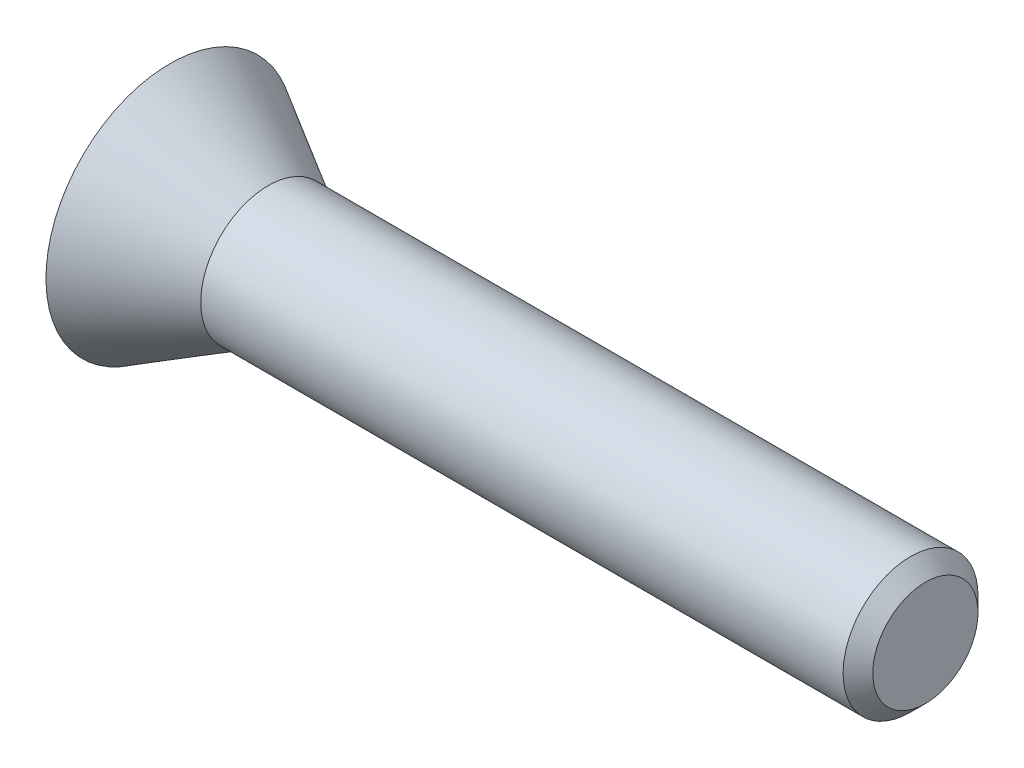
from build123d import *

# Parameters (mm, degrees)
SKETCH1_R           = 2.3
BOSS_EXTRUDE1_DEPTH = 7
CUT_EXTRUDE1_DEPTH  = 0.6
CHAMFER1_SIZE       = 0.275
CUT_EXTRUDE2_DEPTH  = 0.6


with BuildPart() as part:
    # Sketch1 → Boss-Extrude1 (new, symmetric)
    with BuildSketch(Plane(origin=(0, 0, 0), x_dir=(0, 0, -1), z_dir=(1, 0, 0))):
        Circle(SKETCH1_R)
    extrude(amount=BOSS_EXTRUDE1_DEPTH, both=True)

    # Sketch2 → Cut-Revolve1 (revolve, cut)
    with BuildSketch(Plane.XY, mode=Mode.PRIVATE) as cut_revolve1_sk:
        Polygon((-5.181346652, 1.25), (7, 1.25), (7, 2.3), (-7, 2.3), align=None)
    revolve(cut_revolve1_sk.sketch.rotate(Axis((-7, 0, 0), (1, 0, 0)), 180), axis=Axis((-7, 0, 0), (1, 0, 0)), mode=Mode.SUBTRACT)

    # Sketch3 → Cut-Extrude1 (cut)
    with BuildSketch(Plane.ZY.offset(7)):
        with BuildLine():
            Line((0.23, 1.01), (0.23, -1.52))
            ThreePointArc((0.23, -1.52), (0, -1.75), (-0.23, -1.52))
            Line((-0.23, -1.52), (-0.23, 1.01))
            Line((-0.23, 1.01), (-0.55, 1.01))
            Line((-0.55, 1.01), (0, 1.93))
            Line((0, 1.93), (0.55, 1.01))
            Line((0.55, 1.01), (0.23, 1.01))
        make_face()
    extrude(amount=-CUT_EXTRUDE1_DEPTH, mode=Mode.SUBTRACT)

    # Chamfer1
    chamfer1_edges = [part.edges().sort_by_distance(p)[0] for p in [
        (7, 1.25, 0),
    ]]
    chamfer(chamfer1_edges, length=CHAMFER1_SIZE)

    # Sketch4 → Cut-Extrude2 (cut)
    with BuildSketch(Plane.ZY.offset(7)):
        with BuildLine():
            add(Edge.make_bspline(
                [(-1.031669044, -0.814550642), (-1.018634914, -0.814409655), (-0.992914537, -0.814131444), (-0.955094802, -0.811236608), (-0.918608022, -0.806397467), (-0.883653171, -0.799573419), (-0.850133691, -0.790964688), (-0.817906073, -0.780789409), (-0.787280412, -0.768192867), (-0.757959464, -0.753908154), (-0.730356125, -0.737740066), (-0.704528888, -0.719554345), (-0.680221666, -0.69992158), (-0.657618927, -0.678448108), (-0.636744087, -0.655259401), (-0.617478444, -0.630329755), (-0.60021791, -0.603500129), (-0.584427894, -0.575132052), (-0.570379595, -0.545147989), (-0.558522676, -0.513404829), (-0.54824283, -0.480253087), (-0.5396436, -0.445698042), (-0.533059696, -0.409582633), (-0.528671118, -0.371934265), (-0.525628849, -0.332717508), (-0.525377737, -0.306045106), (-0.525249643, -0.292439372)],
                knots=[0, 0, 0, 0, 1.134237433, 2.238201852, 3.298772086, 4.336057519, 5.335809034, 6.309558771, 7.274828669, 8.21507465, 9.146315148, 10.055631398, 10.961815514, 11.863452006, 12.765999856, 13.674901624, 14.60241943, 15.539819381, 16.498894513, 17.481225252, 18.486546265, 19.518401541, 20.578551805, 21.679128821, 22.816111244, 24, 24, 24, 24], degree=3))
            Line((-0.525249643, -0.292439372), (-0.525249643, 0.091583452))
            add(Edge.make_bspline(
                [(-0.525249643, 0.091583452), (-0.525377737, 0.105189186), (-0.52562885, 0.131861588), (-0.528671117, 0.171078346), (-0.533059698, 0.208726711), (-0.539643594, 0.244842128), (-0.548242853, 0.279397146), (-0.558522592, 0.312548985), (-0.5703799, 0.344291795), (-0.584426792, 0.374277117), (-0.600221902, 0.402640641), (-0.617463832, 0.429486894), (-0.636840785, 0.454411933), (-0.657517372, 0.477873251), (-0.680234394, 0.49934051), (-0.704528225, 0.518980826), (-0.730345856, 0.53719188), (-0.758039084, 0.553269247), (-0.787191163, 0.568001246), (-0.817975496, 0.580398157), (-0.850070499, 0.591060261), (-0.88366293, 0.599544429), (-0.918605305, 0.606405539), (-0.955095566, 0.611234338), (-0.992914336, 0.614132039), (-1.018634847, 0.614409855), (-1.031669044, 0.614550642)],
                knots=[0, 0, 0, 0, 1.183277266, 2.319672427, 3.419680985, 4.479283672, 5.510605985, 6.515407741, 7.497231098, 8.455810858, 9.392726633, 10.319765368, 11.22819768, 12.136441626, 13.037612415, 13.943328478, 14.852175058, 15.782934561, 16.726365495, 17.691136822, 18.666946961, 19.666182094, 20.70293176, 21.7629542, 22.866348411, 24, 24, 24, 24], degree=3))
            add(Edge.make_bspline(
                [(-1.031669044, 0.614550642), (-1.053118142, 0.61397665), (-1.095163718, 0.612851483), (-1.156273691, 0.601554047), (-1.213981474, 0.583965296), (-1.267949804, 0.558885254), (-1.318009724, 0.527241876), (-1.36357515, 0.488741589), (-1.404630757, 0.443888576), (-1.440822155, 0.392499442), (-1.472252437, 0.335291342), (-1.49812704, 0.272257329), (-1.519129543, 0.203867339), (-1.528451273, 0.155882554), (-1.533238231, 0.131241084)],
                knots=[0, 0, 0, 0, 1.00806925, 1.976066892, 2.912865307, 3.839664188, 4.766819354, 5.690806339, 6.637604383, 7.619531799, 8.640729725, 9.701744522, 10.819784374, 12, 12, 12, 12], degree=3))
            Line((-1.533238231, 0.131241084), (-1.259914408, 0.131241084))
            add(Edge.make_bspline(
                [(-1.259914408, 0.131241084), (-1.257157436, 0.142424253), (-1.251792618, 0.164185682), (-1.240746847, 0.195143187), (-1.228186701, 0.223818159), (-1.212825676, 0.249527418), (-1.19610348, 0.272891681), (-1.177244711, 0.293133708), (-1.156662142, 0.31058928), (-1.134514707, 0.325026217), (-1.110862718, 0.336792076), (-1.085598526, 0.344578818), (-1.059070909, 0.349663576), (-1.040918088, 0.35031171), (-1.031669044, 0.35064194)],
                knots=[0, 0, 0, 0, 1.203096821, 2.341117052, 3.431111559, 4.469295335, 5.465369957, 6.42892467, 7.35290722, 8.279239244, 9.186115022, 10.104036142, 11.033987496, 12, 12, 12, 12], degree=3))
            add(Edge.make_bspline(
                [(-1.031669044, 0.35064194), (-1.019764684, 0.350225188), (-0.996777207, 0.349420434), (-0.963475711, 0.344177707), (-0.933141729, 0.334301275), (-0.905351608, 0.321199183), (-0.880526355, 0.304229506), (-0.858932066, 0.283426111), (-0.840557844, 0.259071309), (-0.825074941, 0.231584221), (-0.813103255, 0.200731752), (-0.804679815, 0.166894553), (-0.799467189, 0.130166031), (-0.798877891, 0.104725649), (-0.798573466, 0.091583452)],
                knots=[0, 0, 0, 0, 1.082677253, 2.090664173, 3.053339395, 3.973921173, 4.875832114, 5.774919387, 6.688160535, 7.640683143, 8.634736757, 9.687648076, 10.805466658, 12, 12, 12, 12], degree=3))
            Line((-0.798573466, 0.091583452), (-0.798573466, -0.292439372))
            add(Edge.make_bspline(
                [(-0.798573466, -0.292439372), (-0.798881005, -0.305580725), (-0.799476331, -0.331019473), (-0.804633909, -0.367667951), (-0.813166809, -0.401378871), (-0.82500524, -0.432094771), (-0.840555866, -0.459377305), (-0.859023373, -0.483446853), (-0.880514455, -0.504245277), (-0.9053627, -0.52116751), (-0.933082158, -0.53440426), (-0.963566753, -0.543708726), (-0.996735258, -0.549549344), (-1.0197558, -0.550269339), (-1.031669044, -0.55064194)],
                knots=[0, 0, 0, 0, 1.196920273, 2.316972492, 3.363591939, 4.359631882, 5.306515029, 6.214703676, 7.115587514, 8.019300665, 8.94172196, 9.903709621, 10.915159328, 12, 12, 12, 12], degree=3))
            add(Edge.make_bspline(
                [(-1.031669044, -0.55064194), (-1.041099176, -0.550270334), (-1.059595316, -0.549541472), (-1.086616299, -0.545079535), (-1.11205742, -0.536856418), (-1.136090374, -0.52577686), (-1.158538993, -0.511462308), (-1.178763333, -0.493775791), (-1.197601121, -0.473643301), (-1.214367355, -0.450409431), (-1.229229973, -0.42440946), (-1.241659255, -0.395633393), (-1.252448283, -0.3644017), (-1.257374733, -0.342332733), (-1.259914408, -0.330955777)],
                knots=[0, 0, 0, 0, 0.981077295, 1.924272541, 2.837745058, 3.753838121, 4.670304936, 5.59622504, 6.54113043, 7.532377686, 8.569122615, 9.649813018, 10.788435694, 12, 12, 12, 12], degree=3))
            Line((-1.259914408, -0.330955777), (-1.533238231, -0.330955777))
            add(Edge.make_bspline(
                [(-1.533238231, -0.330955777), (-1.528362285, -0.355694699), (-1.518882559, -0.403791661), (-1.497579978, -0.472285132), (-1.471328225, -0.535215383), (-1.440087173, -0.59248802), (-1.403666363, -0.643536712), (-1.36293723, -0.688552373), (-1.317555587, -0.727155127), (-1.267614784, -0.758957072), (-1.213690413, -0.783958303), (-1.156077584, -0.80151607), (-1.095073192, -0.812875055), (-1.053119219, -0.813983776), (-1.031669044, -0.814550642)],
                knots=[0, 0, 0, 0, 1.185884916, 2.305575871, 3.368634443, 4.390138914, 5.368714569, 6.312778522, 7.23993122, 8.163588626, 9.090665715, 10.027745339, 10.991628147, 12, 12, 12, 12], degree=3))
        make_face()
    extrude(amount=-CUT_EXTRUDE2_DEPTH, mode=Mode.SUBTRACT)


solid = part.part
